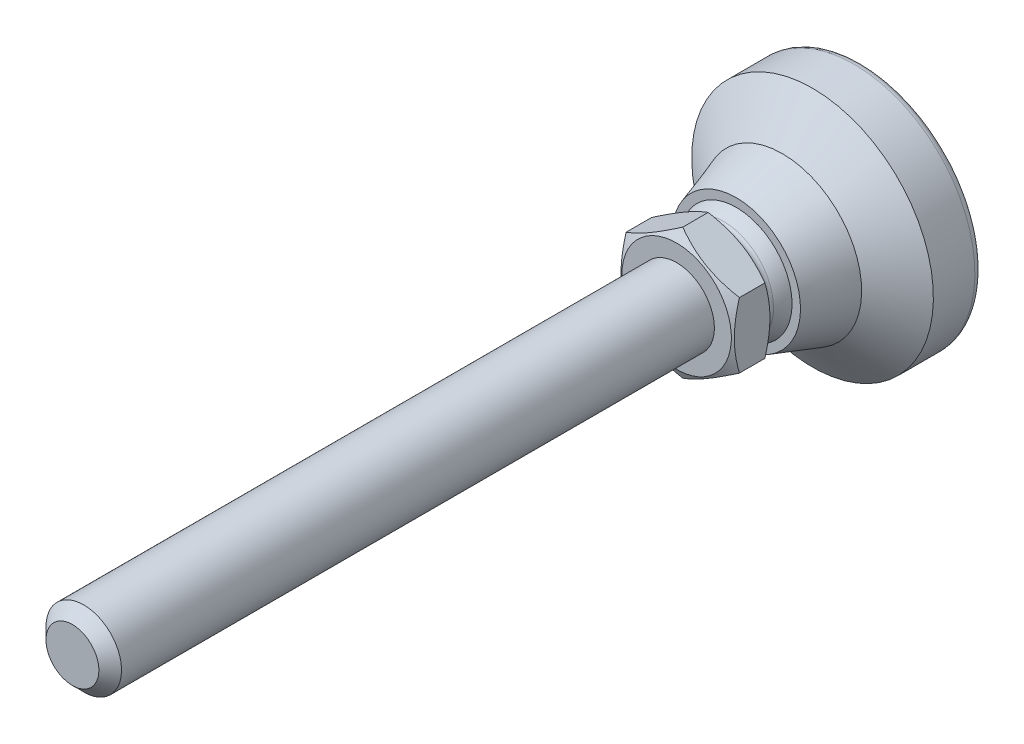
ISO-10303-21;
HEADER;
FILE_DESCRIPTION(('STEP AP214'),'2;1');
FILE_NAME('part.step','',(''),(''),'','','');
FILE_SCHEMA(('AUTOMOTIVE_DESIGN { 1 0 10303 214 1 1 1 1 }'));
ENDSEC;
DATA;
#1=APPLICATION_CONTEXT('core data for automotive mechanical design processes');
#2=APPLICATION_PROTOCOL_DEFINITION('international standard','automotive_design',2000,#1);
#3=PRODUCT_CONTEXT('',#1,'mechanical');
#4=PRODUCT('Part','Part','',(#3));
#5=PRODUCT_RELATED_PRODUCT_CATEGORY('part','',(#4));
#6=PRODUCT_DEFINITION_FORMATION('','',#4);
#7=PRODUCT_DEFINITION_CONTEXT('part definition',#1,'design');
#8=PRODUCT_DEFINITION('design','',#6,#7);
#9=PRODUCT_DEFINITION_SHAPE('','',#8);
#10=(LENGTH_UNIT() NAMED_UNIT(*) SI_UNIT(.MILLI.,.METRE.));
#11=(NAMED_UNIT(*) PLANE_ANGLE_UNIT() SI_UNIT($,.RADIAN.));
#12=(NAMED_UNIT(*) SI_UNIT($,.STERADIAN.) SOLID_ANGLE_UNIT());
#13=UNCERTAINTY_MEASURE_WITH_UNIT(LENGTH_MEASURE(1.E-05),#10,'distance_accuracy_value','');
#14=(GEOMETRIC_REPRESENTATION_CONTEXT(3) GLOBAL_UNCERTAINTY_ASSIGNED_CONTEXT((#13)) GLOBAL_UNIT_ASSIGNED_CONTEXT((#10,
#11,#12)) REPRESENTATION_CONTEXT('',''));
#15=CARTESIAN_POINT('',(0.,0.,0.));
#16=DIRECTION('',(0.,0.,1.));
#17=DIRECTION('',(1.,0.,0.));
#18=AXIS2_PLACEMENT_3D('',#15,#16,#17);
#19=CARTESIAN_POINT('',(0.,0.,18.7011230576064));
#20=DIRECTION('',(0.,0.,-1.));
#21=DIRECTION('',(0.,1.,0.));
#22=AXIS2_PLACEMENT_3D('',#19,#20,#21);
#23=TOROIDAL_SURFACE('',#22,7.30000010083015,0.799999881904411);
#24=CARTESIAN_POINT('',(0.,0.,19.5000000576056));
#25=DIRECTION('',(0.,0.,1.));
#26=DIRECTION('',(1.,0.,0.));
#27=AXIS2_PLACEMENT_3D('',#24,#25,#26);
#28=CIRCLE('',#27,7.25762853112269);
#29=CARTESIAN_POINT('',(7.25762853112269,0.,19.5000000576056));
#30=VERTEX_POINT('',#29);
#31=EDGE_CURVE('E264',#30,#30,#28,.F.);
#32=ORIENTED_EDGE('',*,*,#31,.T.);
#33=EDGE_LOOP('',(#32));
#34=FACE_BOUND('',#33,.T.);
#35=CARTESIAN_POINT('',(0.,0.,18.2846441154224));
#36=DIRECTION('',(0.,0.,-1.));
#37=DIRECTION('',(0.,1.,0.));
#38=AXIS2_PLACEMENT_3D('',#35,#36,#37);
#39=CIRCLE('',#38,6.61695903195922);
#40=CARTESIAN_POINT('',(-6.61695903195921,0.,18.2846441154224));
#41=VERTEX_POINT('',#40);
#42=EDGE_CURVE('E73',#41,#41,#39,.T.);
#43=ORIENTED_EDGE('',*,*,#42,.F.);
#44=EDGE_LOOP('',(#43));
#45=FACE_BOUND('',#44,.T.);
#46=ADVANCED_FACE('F14',(#34,#45),#23,.F.);
#47=CARTESIAN_POINT('',(0.,0.,14.249999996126));
#48=DIRECTION('',(0.,0.,-1.));
#49=DIRECTION('',(-1.,0.,0.));
#50=AXIS2_PLACEMENT_3D('',#47,#48,#49);
#51=SPHERICAL_SURFACE('',#50,7.75);
#52=CARTESIAN_POINT('',(0.,0.,16.6));
#53=DIRECTION('',(0.,0.,-1.));
#54=DIRECTION('',(0.,1.,0.));
#55=AXIS2_PLACEMENT_3D('',#52,#53,#54);
#56=CIRCLE('',#55,7.38512017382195);
#57=CARTESIAN_POINT('',(-7.38512017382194,0.,16.6));
#58=VERTEX_POINT('',#57);
#59=EDGE_CURVE('E120',#58,#58,#56,.T.);
#60=CARTESIAN_POINT('',(-7.38512017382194,0.,16.6));
#61=CARTESIAN_POINT('',(-7.37925798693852,0.,16.6184225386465));
#62=CARTESIAN_POINT('',(-7.37332686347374,0.,16.6368231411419));
#63=CARTESIAN_POINT('',(-7.36132708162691,0.,16.6735794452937));
#64=CARTESIAN_POINT('',(-7.35525842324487,0.,16.6919351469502));
#65=CARTESIAN_POINT('',(-7.34298390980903,0.,16.7286006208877));
#66=CARTESIAN_POINT('',(-7.33677805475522,0.,16.7469103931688));
#67=CARTESIAN_POINT('',(-7.3242294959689,0.,16.7834829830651));
#68=CARTESIAN_POINT('',(-7.31788679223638,0.,16.8017458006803));
#69=CARTESIAN_POINT('',(-7.30506489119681,0.,16.8382234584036));
#70=CARTESIAN_POINT('',(-7.29858569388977,0.,16.8564382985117));
#71=CARTESIAN_POINT('',(-7.28549116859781,0.,16.8928189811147));
#72=CARTESIAN_POINT('',(-7.2788758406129,0.,16.9109848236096));
#73=CARTESIAN_POINT('',(-7.2655094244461,0.,16.9472664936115));
#74=CARTESIAN_POINT('',(-7.25875833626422,0.,16.9653823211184));
#75=CARTESIAN_POINT('',(-7.24512077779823,0.,17.0015629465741));
#76=CARTESIAN_POINT('',(-7.23823430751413,0.,17.0196277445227));
#77=CARTESIAN_POINT('',(-7.22432637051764,0.,17.0557052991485));
#78=CARTESIAN_POINT('',(-7.21730490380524,0.,17.0737180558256));
#79=CARTESIAN_POINT('',(-7.20312736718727,0.,17.1096905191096));
#80=CARTESIAN_POINT('',(-7.19597129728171,0.,17.1276502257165));
#81=CARTESIAN_POINT('',(-7.18152495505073,0.,17.1635155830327));
#82=CARTESIAN_POINT('',(-7.17423468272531,0.,17.1814212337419));
#83=CARTESIAN_POINT('',(-7.15952034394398,0.,17.2171774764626));
#84=CARTESIAN_POINT('',(-7.15209627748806,0.,17.235028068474));
#85=CARTESIAN_POINT('',(-7.13711476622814,0.,17.2706731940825));
#86=CARTESIAN_POINT('',(-7.12955732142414,0.,17.2884677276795));
#87=CARTESIAN_POINT('',(-7.11430947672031,0.,17.323999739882));
#88=CARTESIAN_POINT('',(-7.10661907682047,0.,17.3417372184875));
#89=CARTESIAN_POINT('',(-7.0911057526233,0.,17.3771541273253));
#90=CARTESIAN_POINT('',(-7.08328282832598,0.,17.3948335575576));
#91=CARTESIAN_POINT('',(-7.06750489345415,0.,17.4301333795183));
#92=CARTESIAN_POINT('',(-7.05954988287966,0.,17.4477537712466));
#93=CARTESIAN_POINT('',(-7.0435082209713,0.,17.482934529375));
#94=CARTESIAN_POINT('',(-7.03542156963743,0.,17.5004948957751));
#95=CARTESIAN_POINT('',(-7.01911707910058,0.,17.5355546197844));
#96=CARTESIAN_POINT('',(-7.01089923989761,0.,17.5530539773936));
#97=CARTESIAN_POINT('',(-6.99433283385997,0.,17.5879907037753));
#98=CARTESIAN_POINT('',(-6.98598426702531,0.,17.6054280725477));
#99=CARTESIAN_POINT('',(-6.96915687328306,0.,17.6402398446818));
#100=CARTESIAN_POINT('',(-6.96067804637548,0.,17.6576142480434));
#101=CARTESIAN_POINT('',(-6.94359060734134,0.,17.692299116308));
#102=CARTESIAN_POINT('',(-6.93498199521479,0.,17.7096095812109));
#103=CARTESIAN_POINT('',(-6.91763546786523,0.,17.7441656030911));
#104=CARTESIAN_POINT('',(-6.90889755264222,0.,17.7614111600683));
#105=CARTESIAN_POINT('',(-6.89129290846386,0.,17.7958364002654));
#106=CARTESIAN_POINT('',(-6.8824261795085,0.,17.8130160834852));
#107=CARTESIAN_POINT('',(-6.86456440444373,0.,17.8473086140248));
#108=CARTESIAN_POINT('',(-6.85556935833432,0.,17.8644214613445));
#109=CARTESIAN_POINT('',(-6.83745145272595,0.,17.8985793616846));
#110=CARTESIAN_POINT('',(-6.82832859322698,0.,17.9156244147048));
#111=CARTESIAN_POINT('',(-6.80995557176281,0.,17.9496457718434));
#112=CARTESIAN_POINT('',(-6.80070540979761,0.,17.9666220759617));
#113=CARTESIAN_POINT('',(-6.78207830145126,0.,18.0005049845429));
#114=CARTESIAN_POINT('',(-6.7727013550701,0.,18.0174115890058));
#115=CARTESIAN_POINT('',(-6.75382120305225,0.,18.0511541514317));
#116=CARTESIAN_POINT('',(-6.74431799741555,0.,18.0679901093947));
#117=CARTESIAN_POINT('',(-6.72518585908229,0.,18.1015904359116));
#118=CARTESIAN_POINT('',(-6.71555692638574,0.,18.1183548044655));
#119=CARTESIAN_POINT('',(-6.69617387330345,0.,18.1518110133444));
#120=CARTESIAN_POINT('',(-6.68641975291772,0.,18.1685028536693));
#121=CARTESIAN_POINT('',(-6.66678687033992,0.,18.2018130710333));
#122=CARTESIAN_POINT('',(-6.65690810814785,0.,18.2184314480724));
#123=CARTESIAN_POINT('',(-6.63702649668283,0.,18.2515938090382));
#124=CARTESIAN_POINT('',(-6.62702364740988,0.,18.2681377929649));
#125=CARTESIAN_POINT('',(-6.61695903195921,0.,18.2846441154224));
#126=B_SPLINE_CURVE_WITH_KNOTS('',3,(#60,#61,#62,#63,#64,#65,#66,#67,#68,#69,#70,#71,#72,#73,
#74,#75,#76,#77,#78,#79,#80,#81,#82,#83,#84,#85,#86,#87,#88,#89,#90,#91,#92,#93,#94,#95,#96,#97,
#98,#99,#100,#101,#102,#103,#104,#105,#106,#107,#108,#109,#110,#111,#112,#113,#114,#115,#116,
#117,#118,#119,#120,#121,#122,#123,#124,#125),.UNSPECIFIED.,.F.,.F.,(4,2,2,2,2,2,2,2,2,2,2,2,2,
2,2,2,2,2,2,2,2,2,2,2,2,2,2,2,2,2,2,2,4),(0.,0.0579981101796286,0.115996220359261,
0.173994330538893,0.231992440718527,0.289990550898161,0.347988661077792,0.405986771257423,
0.463984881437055,0.521982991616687,0.579981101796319,0.637979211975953,0.695977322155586,
0.753975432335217,0.811973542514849,0.86997165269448,0.927969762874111,0.985967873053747,
1.04396598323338,1.10196409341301,1.15996220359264,1.21796031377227,1.27595842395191,
1.33395653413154,1.39195464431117,1.4499527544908,1.50795086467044,1.56594897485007,
1.6239470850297,1.68194519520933,1.73994330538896,1.7979414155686,1.85593952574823),.UNSPECIFIED.);
#127=EDGE_CURVE('BSEAM241',#58,#41,#126,.T.);
#128=ORIENTED_EDGE('',*,*,#59,.F.);
#129=ORIENTED_EDGE('',*,*,#42,.T.);
#130=ORIENTED_EDGE('',*,*,#127,.T.);
#131=ORIENTED_EDGE('',*,*,#127,.F.);
#132=EDGE_LOOP('',(#128,#130,#129,#131));
#133=FACE_BOUND('',#132,.T.);
#134=ADVANCED_FACE('F241',(#133),#51,.T.);
#135=CARTESIAN_POINT('',(-7.38512017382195,0.,16.6));
#136=DIRECTION('',(0.,0.,-1.));
#137=DIRECTION('',(0.,1.,0.));
#138=AXIS2_PLACEMENT_3D('',#135,#136,#137);
#139=PLANE('',#138);
#140=CARTESIAN_POINT('',(0.,0.,16.6));
#141=DIRECTION('',(0.,0.,-1.));
#142=DIRECTION('',(0.,1.,0.));
#143=AXIS2_PLACEMENT_3D('',#140,#141,#142);
#144=CIRCLE('',#143,8.5);
#145=CARTESIAN_POINT('',(0.,8.5,16.6));
#146=VERTEX_POINT('',#145);
#147=EDGE_CURVE('E117',#146,#146,#144,.T.);
#148=ORIENTED_EDGE('',*,*,#147,.F.);
#149=EDGE_LOOP('',(#148));
#150=FACE_BOUND('',#149,.T.);
#151=ORIENTED_EDGE('',*,*,#59,.T.);
#152=EDGE_LOOP('',(#151));
#153=FACE_BOUND('',#152,.T.);
#154=ADVANCED_FACE('F247',(#150,#153),#139,.F.);
#155=CARTESIAN_POINT('',(0.,0.,16.6));
#156=DIRECTION('',(0.,0.,-1.));
#157=DIRECTION('',(0.,1.,0.));
#158=AXIS2_PLACEMENT_3D('',#155,#156,#157);
#159=CONICAL_SURFACE('',#158,8.5,0.316824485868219);
#160=CARTESIAN_POINT('',(0.,0.,10.5));
#161=DIRECTION('',(0.,0.,-1.));
#162=DIRECTION('',(0.,1.,0.));
#163=AXIS2_PLACEMENT_3D('',#160,#161,#162);
#164=CIRCLE('',#163,10.5);
#165=CARTESIAN_POINT('',(0.,10.5,10.5));
#166=VERTEX_POINT('',#165);
#167=EDGE_CURVE('E114',#166,#166,#164,.T.);
#168=ORIENTED_EDGE('',*,*,#167,.F.);
#169=EDGE_LOOP('',(#168));
#170=FACE_BOUND('',#169,.T.);
#171=ORIENTED_EDGE('',*,*,#147,.T.);
#172=EDGE_LOOP('',(#171));
#173=FACE_BOUND('',#172,.T.);
#174=ADVANCED_FACE('F290',(#170,#173),#159,.T.);
#175=CARTESIAN_POINT('',(0.,0.,10.5));
#176=DIRECTION('',(0.,0.,-1.));
#177=DIRECTION('',(0.,1.,0.));
#178=AXIS2_PLACEMENT_3D('',#175,#176,#177);
#179=CONICAL_SURFACE('',#178,10.5,0.942000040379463);
#180=CARTESIAN_POINT('',(0.,0.,6.5));
#181=DIRECTION('',(0.,0.,-1.));
#182=DIRECTION('',(0.,1.,0.));
#183=AXIS2_PLACEMENT_3D('',#180,#181,#182);
#184=CIRCLE('',#183,16.);
#185=CARTESIAN_POINT('',(0.,16.,6.5));
#186=VERTEX_POINT('',#185);
#187=EDGE_CURVE('E111',#186,#186,#184,.T.);
#188=ORIENTED_EDGE('',*,*,#187,.F.);
#189=EDGE_LOOP('',(#188));
#190=FACE_BOUND('',#189,.T.);
#191=ORIENTED_EDGE('',*,*,#167,.T.);
#192=EDGE_LOOP('',(#191));
#193=FACE_BOUND('',#192,.T.);
#194=ADVANCED_FACE('F286',(#190,#193),#179,.T.);
#195=CARTESIAN_POINT('',(0.,0.,0.));
#196=DIRECTION('',(0.,0.,-1.));
#197=DIRECTION('',(0.,1.,0.));
#198=AXIS2_PLACEMENT_3D('',#195,#196,#197);
#199=CYLINDRICAL_SURFACE('',#198,16.);
#200=CARTESIAN_POINT('',(0.,0.,1.));
#201=DIRECTION('',(0.,0.,-1.));
#202=DIRECTION('',(0.,1.,0.));
#203=AXIS2_PLACEMENT_3D('',#200,#201,#202);
#204=CIRCLE('',#203,16.);
#205=CARTESIAN_POINT('',(0.,16.,1.));
#206=VERTEX_POINT('',#205);
#207=EDGE_CURVE('E88',#206,#206,#204,.T.);
#208=ORIENTED_EDGE('',*,*,#207,.F.);
#209=EDGE_LOOP('',(#208));
#210=FACE_BOUND('',#209,.T.);
#211=ORIENTED_EDGE('',*,*,#187,.T.);
#212=EDGE_LOOP('',(#211));
#213=FACE_BOUND('',#212,.T.);
#214=ADVANCED_FACE('F280',(#210,#213),#199,.T.);
#215=CARTESIAN_POINT('',(0.,0.,1.));
#216=DIRECTION('',(0.,0.,-1.));
#217=DIRECTION('',(0.,1.,0.));
#218=AXIS2_PLACEMENT_3D('',#215,#216,#217);
#219=TOROIDAL_SURFACE('',#218,15.,1.);
#220=CARTESIAN_POINT('',(0.,0.,0.));
#221=DIRECTION('',(0.,0.,-1.));
#222=DIRECTION('',(0.,1.,0.));
#223=AXIS2_PLACEMENT_3D('',#220,#221,#222);
#224=CIRCLE('',#223,15.);
#225=CARTESIAN_POINT('',(0.,15.,0.));
#226=VERTEX_POINT('',#225);
#227=EDGE_CURVE('E85',#226,#226,#224,.T.);
#228=ORIENTED_EDGE('',*,*,#227,.F.);
#229=EDGE_LOOP('',(#228));
#230=FACE_BOUND('',#229,.T.);
#231=ORIENTED_EDGE('',*,*,#207,.T.);
#232=EDGE_LOOP('',(#231));
#233=FACE_BOUND('',#232,.T.);
#234=ADVANCED_FACE('F273',(#230,#233),#219,.T.);
#235=CARTESIAN_POINT('',(-15.,0.,0.));
#236=DIRECTION('',(0.,0.,1.));
#237=DIRECTION('',(0.,-1.,0.));
#238=AXIS2_PLACEMENT_3D('',#235,#236,#237);
#239=PLANE('',#238);
#240=ORIENTED_EDGE('',*,*,#227,.T.);
#241=EDGE_LOOP('',(#240));
#242=FACE_BOUND('',#241,.T.);
#243=ADVANCED_FACE('F268',(#242),#239,.F.);
#244=CARTESIAN_POINT('',(0.,7.25,19.5000000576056));
#245=DIRECTION('',(0.,0.,-1.));
#246=DIRECTION('',(-1.,0.,0.));
#247=AXIS2_PLACEMENT_3D('',#244,#245,#246);
#248=PLANE('',#247);
#249=CARTESIAN_POINT('',(0.,0.,19.5000000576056));
#250=DIRECTION('',(0.,0.,-1.));
#251=DIRECTION('',(-1.,0.,0.));
#252=AXIS2_PLACEMENT_3D('',#249,#250,#251);
#253=CIRCLE('',#252,7.25);
#254=CARTESIAN_POINT('',(-7.25,0.,19.5000000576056));
#255=VERTEX_POINT('',#254);
#256=EDGE_CURVE('E79',#255,#255,#253,.T.);
#257=ORIENTED_EDGE('',*,*,#256,.T.);
#258=EDGE_LOOP('',(#257));
#259=FACE_BOUND('',#258,.T.);
#260=ORIENTED_EDGE('',*,*,#31,.F.);
#261=EDGE_LOOP('',(#260));
#262=FACE_BOUND('',#261,.T.);
#263=ADVANCED_FACE('F139',(#259,#262),#248,.F.);
#264=CARTESIAN_POINT('',(0.,0.,21.1177006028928));
#265=DIRECTION('',(0.,0.,1.));
#266=DIRECTION('',(1.,0.,0.));
#267=AXIS2_PLACEMENT_3D('',#264,#265,#266);
#268=CONICAL_SURFACE('',#267,10.0519395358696,1.0471975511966);
#269=CARTESIAN_POINT('',(-7.5002,4.33001154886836,20.3142772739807));
#270=CARTESIAN_POINT('',(-7.3353416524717,4.42519256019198,20.2593328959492));
#271=CARTESIAN_POINT('',(-7.16986863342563,4.52072845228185,20.2068821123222));
#272=CARTESIAN_POINT('',(-6.83757877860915,4.71257608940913,20.1076545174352));
#273=CARTESIAN_POINT('',(-6.67076139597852,4.80888815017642,20.0608801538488));
#274=CARTESIAN_POINT('',(-6.16763831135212,5.09936639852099,19.9299898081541));
#275=CARTESIAN_POINT('',(-5.82934661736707,5.29467919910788,19.8555409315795));
#276=CARTESIAN_POINT('',(-5.32309925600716,5.58696124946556,19.7682409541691));
#277=CARTESIAN_POINT('',(-5.15665618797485,5.68305719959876,19.7433717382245));
#278=CARTESIAN_POINT('',(-4.82301799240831,5.87568330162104,19.7016697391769));
#279=CARTESIAN_POINT('',(-4.65582293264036,5.97221341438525,19.6848362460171));
#280=CARTESIAN_POINT('',(-4.32114243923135,6.16544128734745,19.6596346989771));
#281=CARTESIAN_POINT('',(-4.15365755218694,6.26213873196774,19.6512570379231));
#282=CARTESIAN_POINT('',(-3.81854232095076,6.45561760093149,19.6431378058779));
#283=CARTESIAN_POINT('',(-3.65091198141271,6.55239902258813,19.6433959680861));
#284=CARTESIAN_POINT('',(-3.19166219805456,6.81754700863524,19.6559736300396));
#285=CARTESIAN_POINT('',(-2.90019309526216,6.98582677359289,19.6770872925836));
#286=CARTESIAN_POINT('',(-2.31919079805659,7.32126860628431,19.7440382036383));
#287=CARTESIAN_POINT('',(-2.02965964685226,7.48842949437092,19.7898983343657));
#288=CARTESIAN_POINT('',(-1.44748813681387,7.82454637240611,19.9045350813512));
#289=CARTESIAN_POINT('',(-1.15492123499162,7.99345995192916,19.9737973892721));
#290=CARTESIAN_POINT('',(-0.574150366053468,8.3287681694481,20.1309947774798));
#291=CARTESIAN_POINT('',(-0.285938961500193,8.49516710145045,20.2188929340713));
#292=CARTESIAN_POINT('',(0.000200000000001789,8.66036950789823,20.3142772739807));
#293=B_SPLINE_CURVE_WITH_KNOTS('',3,(#269,#270,#271,#272,#273,#274,#275,#276,#277,#278,#279,
#280,#281,#282,#283,#284,#285,#286,#287,#288,#289,#290,#291,#292),.UNSPECIFIED.,.F.,.F.,(4,2,2,
2,2,2,2,2,2,2,2,4),(0.,0.594350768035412,1.1889569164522,2.38063993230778,2.96188692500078,
3.54308254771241,4.12361709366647,4.70413370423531,5.7147367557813,6.72627588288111,
7.7602492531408,8.79219281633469),.UNSPECIFIED.);
#294=CARTESIAN_POINT('',(-7.5,4.3301270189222,20.3142106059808));
#295=VERTEX_POINT('',#294);
#296=CARTESIAN_POINT('',(0.,8.66025403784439,20.3142106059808));
#297=VERTEX_POINT('',#296);
#298=EDGE_CURVE('E29',#295,#297,#293,.T.);
#299=ORIENTED_EDGE('',*,*,#298,.T.);
#300=CARTESIAN_POINT('',(-0.000199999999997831,8.66036950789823,20.3142772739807));
#301=CARTESIAN_POINT('',(0.164658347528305,8.56518849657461,20.2593328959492));
#302=CARTESIAN_POINT('',(0.330131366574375,8.46965260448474,20.2068821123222));
#303=CARTESIAN_POINT('',(0.662421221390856,8.27780496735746,20.1076545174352));
#304=CARTESIAN_POINT('',(0.829238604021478,8.18149290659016,20.0608801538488));
#305=CARTESIAN_POINT('',(1.33236168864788,7.8910146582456,19.9299898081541));
#306=CARTESIAN_POINT('',(1.67065338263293,7.69570185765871,19.8555409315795));
#307=CARTESIAN_POINT('',(2.17690074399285,7.40341980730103,19.7682409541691));
#308=CARTESIAN_POINT('',(2.34334381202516,7.30732385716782,19.7433717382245));
#309=CARTESIAN_POINT('',(2.67698200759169,7.11469775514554,19.7016697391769));
#310=CARTESIAN_POINT('',(2.84417706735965,7.01816764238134,19.6848362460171));
#311=CARTESIAN_POINT('',(3.17885756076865,6.82493976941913,19.6596346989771));
#312=CARTESIAN_POINT('',(3.34634244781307,6.72824232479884,19.6512570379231));
#313=CARTESIAN_POINT('',(3.68145767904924,6.5347634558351,19.6431378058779));
#314=CARTESIAN_POINT('',(3.8490880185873,6.43798203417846,19.6433959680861));
#315=CARTESIAN_POINT('',(4.30833780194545,6.17283404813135,19.6559736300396));
#316=CARTESIAN_POINT('',(4.59980690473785,6.0045542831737,19.6770872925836));
#317=CARTESIAN_POINT('',(5.18080920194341,5.66911245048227,19.7440382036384));
#318=CARTESIAN_POINT('',(5.47034035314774,5.50195156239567,19.7898983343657));
#319=CARTESIAN_POINT('',(6.05251186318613,5.16583468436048,19.9045350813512));
#320=CARTESIAN_POINT('',(6.34507876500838,4.99692110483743,19.9737973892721));
#321=CARTESIAN_POINT('',(6.92584963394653,4.66161288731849,20.1309947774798));
#322=CARTESIAN_POINT('',(7.21406103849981,4.49521395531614,20.2188929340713));
#323=CARTESIAN_POINT('',(7.5002,4.33001154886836,20.3142772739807));
#324=B_SPLINE_CURVE_WITH_KNOTS('',3,(#300,#301,#302,#303,#304,#305,#306,#307,#308,#309,#310,
#311,#312,#313,#314,#315,#316,#317,#318,#319,#320,#321,#322,#323),.UNSPECIFIED.,.F.,.F.,(4,2,2,
2,2,2,2,2,2,2,2,4),(0.,0.594350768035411,1.1889569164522,2.38063993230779,2.96188692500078,
3.54308254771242,4.12361709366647,4.70413370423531,5.71473675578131,6.7262758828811,
7.76024925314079,8.79219281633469),.UNSPECIFIED.);
#325=CARTESIAN_POINT('',(7.5,4.3301270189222,20.3142106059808));
#326=VERTEX_POINT('',#325);
#327=EDGE_CURVE('E66',#297,#326,#324,.T.);
#328=ORIENTED_EDGE('',*,*,#327,.T.);
#329=CARTESIAN_POINT('',(7.5,-11.5758131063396,23.2776572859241));
#330=CARTESIAN_POINT('',(7.5,-11.2486985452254,23.1192011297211));
#331=CARTESIAN_POINT('',(7.5,-10.92082708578,22.9622804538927));
#332=CARTESIAN_POINT('',(7.5,-10.2631676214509,22.6523747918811));
#333=CARTESIAN_POINT('',(7.5,-9.93337931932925,22.4993904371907));
#334=CARTESIAN_POINT('',(7.5,-9.26975750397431,22.1974405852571));
#335=CARTESIAN_POINT('',(7.5,-8.93591170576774,22.0485019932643));
#336=CARTESIAN_POINT('',(7.5,-8.26554536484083,21.7567944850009));
#337=CARTESIAN_POINT('',(7.5,-7.92902495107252,21.6140252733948));
#338=CARTESIAN_POINT('',(7.5,-7.24212993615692,21.3319157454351));
#339=CARTESIAN_POINT('',(7.5,-6.89165247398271,21.1928244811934));
#340=CARTESIAN_POINT('',(7.5,-6.18657762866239,20.9253037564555));
#341=CARTESIAN_POINT('',(7.5,-5.83197978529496,20.7968755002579));
#342=CARTESIAN_POINT('',(7.5,-5.11877756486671,20.5540933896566));
#343=CARTESIAN_POINT('',(7.5,-4.76018316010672,20.4397105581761));
#344=CARTESIAN_POINT('',(7.5,-4.03786411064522,20.228724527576));
#345=CARTESIAN_POINT('',(7.5,-3.67414113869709,20.1321156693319));
#346=CARTESIAN_POINT('',(7.5,-2.94330443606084,19.9618673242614));
#347=CARTESIAN_POINT('',(7.5,-2.57622001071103,19.8881054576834));
#348=CARTESIAN_POINT('',(7.5,-2.02229540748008,19.7978191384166));
#349=CARTESIAN_POINT('',(7.5,-1.83709018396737,19.7711152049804));
#350=CARTESIAN_POINT('',(7.5,-1.46577815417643,19.725017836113));
#351=CARTESIAN_POINT('',(7.5,-1.27967143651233,19.7056236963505));
#352=CARTESIAN_POINT('',(7.5,-0.909212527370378,19.6747726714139));
#353=CARTESIAN_POINT('',(7.5,-0.724868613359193,19.6632167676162));
#354=CARTESIAN_POINT('',(7.5,-0.355857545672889,19.647906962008));
#355=CARTESIAN_POINT('',(7.5,-0.171190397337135,19.6441529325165));
#356=CARTESIAN_POINT('',(7.5,0.198137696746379,19.6445362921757));
#357=CARTESIAN_POINT('',(7.5,0.382798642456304,19.6486737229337));
#358=CARTESIAN_POINT('',(7.5,0.751783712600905,19.6647398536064));
#359=CARTESIAN_POINT('',(7.5,0.93610781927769,19.6766689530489));
#360=CARTESIAN_POINT('',(7.5,1.38078988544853,19.7145962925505));
#361=CARTESIAN_POINT('',(7.5,1.64083115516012,19.7443854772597));
#362=CARTESIAN_POINT('',(7.5,2.15893480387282,19.8178333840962));
#363=CARTESIAN_POINT('',(7.5,2.41699690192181,19.8614940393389));
#364=CARTESIAN_POINT('',(7.5,3.18794688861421,20.0109638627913));
#365=CARTESIAN_POINT('',(7.5,3.69730058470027,20.1352321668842));
#366=CARTESIAN_POINT('',(7.5,4.45884729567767,20.350108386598));
#367=CARTESIAN_POINT('',(7.5,4.71500581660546,20.4274651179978));
#368=CARTESIAN_POINT('',(7.5,5.22483384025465,20.5900595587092));
#369=CARTESIAN_POINT('',(7.5,5.47850332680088,20.6752973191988));
#370=CARTESIAN_POINT('',(7.5,5.9834360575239,20.8522990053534));
#371=CARTESIAN_POINT('',(7.5,6.23470009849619,20.9440606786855));
#372=CARTESIAN_POINT('',(7.5,6.73515677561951,21.1330458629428));
#373=CARTESIAN_POINT('',(7.5,6.98434943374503,21.2302693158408));
#374=CARTESIAN_POINT('',(7.5,7.5629390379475,21.4621490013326));
#375=CARTESIAN_POINT('',(7.5,7.89163158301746,21.5985593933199));
#376=CARTESIAN_POINT('',(7.5,8.54630249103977,21.8777627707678));
#377=CARTESIAN_POINT('',(7.5,8.87228070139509,22.0205561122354));
#378=CARTESIAN_POINT('',(7.5,9.52200980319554,22.3112700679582));
#379=CARTESIAN_POINT('',(7.5,9.84576026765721,22.4591916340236));
#380=CARTESIAN_POINT('',(7.5,10.4913488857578,22.7591577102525));
#381=CARTESIAN_POINT('',(7.5,10.8131870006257,22.9112023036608));
#382=CARTESIAN_POINT('',(7.5,11.4555752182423,23.2188077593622));
#383=CARTESIAN_POINT('',(7.5,11.7761236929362,23.3743720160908));
#384=CARTESIAN_POINT('',(7.5,12.4158574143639,23.6882812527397));
#385=CARTESIAN_POINT('',(7.5,12.7350426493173,23.8466262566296));
#386=CARTESIAN_POINT('',(7.5,13.6907942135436,24.3250671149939));
#387=CARTESIAN_POINT('',(7.5,14.3256361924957,24.6486073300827));
#388=CARTESIAN_POINT('',(7.5,15.5404354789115,25.2755960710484));
#389=CARTESIAN_POINT('',(7.5,16.1206556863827,25.5785374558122));
#390=CARTESIAN_POINT('',(7.5,17.2789319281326,26.188572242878));
#391=CARTESIAN_POINT('',(7.5,17.8569878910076,26.4956657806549));
#392=CARTESIAN_POINT('',(7.5,19.0100376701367,27.1122939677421));
#393=CARTESIAN_POINT('',(7.5,19.5850354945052,27.4218211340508));
#394=CARTESIAN_POINT('',(7.5,20.7336417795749,28.0433721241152));
#395=CARTESIAN_POINT('',(7.5,21.307250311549,28.3553958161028));
#396=CARTESIAN_POINT('',(7.5,21.8803447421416,28.6683546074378));
#397=B_SPLINE_CURVE_WITH_KNOTS('',3,(#329,#330,#331,#332,#333,#334,#335,#336,#337,#338,#339,
#340,#341,#342,#343,#344,#345,#346,#347,#348,#349,#350,#351,#352,#353,#354,#355,#356,#357,#358,
#359,#360,#361,#362,#363,#364,#365,#366,#367,#368,#369,#370,#371,#372,#373,#374,#375,#376,#377,
#378,#379,#380,#381,#382,#383,#384,#385,#386,#387,#388,#389,#390,#391,#392,#393,#394,#395,#396),
.UNSPECIFIED.,.F.,.F.,(4,2,2,2,2,2,2,2,2,2,2,2,2,2,2,2,2,2,2,2,2,2,2,2,2,2,2,2,2,2,2,2,2,4),(0.,
1.09043121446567,2.18103628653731,3.27767289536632,4.37425694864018,5.50532856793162,
6.63652775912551,7.76535250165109,8.89381720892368,10.0161283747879,10.5773682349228,
11.1385540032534,11.6925113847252,12.2464597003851,12.8004109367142,13.3543905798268,
14.1391718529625,14.9240625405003,16.4947377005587,17.2974250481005,18.100117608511,
18.9025343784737,19.7049426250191,20.772475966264,21.8400689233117,22.9078611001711,
23.9756748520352,25.0445664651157,26.1134672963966,28.2510031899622,30.2146197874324,
32.1783006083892,34.1373412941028,36.0962792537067),.UNSPECIFIED.);
#398=CARTESIAN_POINT('',(7.5,-4.3301270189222,20.3142106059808));
#399=VERTEX_POINT('',#398);
#400=EDGE_CURVE('E69',#326,#399,#397,.F.);
#401=ORIENTED_EDGE('',*,*,#400,.T.);
#402=CARTESIAN_POINT('',(7.5002,-4.33001154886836,20.3142772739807));
#403=CARTESIAN_POINT('',(7.3353416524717,-4.42519256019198,20.2593328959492));
#404=CARTESIAN_POINT('',(7.16986863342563,-4.52072845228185,20.2068821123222));
#405=CARTESIAN_POINT('',(6.83757877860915,-4.71257608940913,20.1076545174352));
#406=CARTESIAN_POINT('',(6.67076139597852,-4.80888815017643,20.0608801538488));
#407=CARTESIAN_POINT('',(6.16763831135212,-5.09936639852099,19.9299898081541));
#408=CARTESIAN_POINT('',(5.82934661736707,-5.29467919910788,19.8555409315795));
#409=CARTESIAN_POINT('',(5.32309925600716,-5.58696124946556,19.7682409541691));
#410=CARTESIAN_POINT('',(5.15665618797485,-5.68305719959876,19.7433717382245));
#411=CARTESIAN_POINT('',(4.82301799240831,-5.87568330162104,19.7016697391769));
#412=CARTESIAN_POINT('',(4.65582293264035,-5.97221341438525,19.6848362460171));
#413=CARTESIAN_POINT('',(4.32114243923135,-6.16544128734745,19.6596346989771));
#414=CARTESIAN_POINT('',(4.15365755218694,-6.26213873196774,19.6512570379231));
#415=CARTESIAN_POINT('',(3.81854232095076,-6.45561760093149,19.6431378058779));
#416=CARTESIAN_POINT('',(3.65091198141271,-6.55239902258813,19.6433959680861));
#417=CARTESIAN_POINT('',(3.19166219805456,-6.81754700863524,19.6559736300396));
#418=CARTESIAN_POINT('',(2.90019309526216,-6.98582677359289,19.6770872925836));
#419=CARTESIAN_POINT('',(2.31919079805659,-7.32126860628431,19.7440382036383));
#420=CARTESIAN_POINT('',(2.02965964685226,-7.48842949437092,19.7898983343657));
#421=CARTESIAN_POINT('',(1.44748813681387,-7.82454637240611,19.9045350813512));
#422=CARTESIAN_POINT('',(1.15492123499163,-7.99345995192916,19.9737973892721));
#423=CARTESIAN_POINT('',(0.574150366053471,-8.3287681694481,20.1309947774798));
#424=CARTESIAN_POINT('',(0.285938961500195,-8.49516710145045,20.2188929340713));
#425=CARTESIAN_POINT('',(-0.000199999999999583,-8.66036950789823,20.3142772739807));
#426=B_SPLINE_CURVE_WITH_KNOTS('',3,(#402,#403,#404,#405,#406,#407,#408,#409,#410,#411,#412,
#413,#414,#415,#416,#417,#418,#419,#420,#421,#422,#423,#424,#425),.UNSPECIFIED.,.F.,.F.,(4,2,2,
2,2,2,2,2,2,2,2,4),(0.,0.594350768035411,1.1889569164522,2.38063993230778,2.96188692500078,
3.54308254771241,4.12361709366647,4.7041337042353,5.7147367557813,6.7262758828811,
7.76024925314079,8.79219281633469),.UNSPECIFIED.);
#427=CARTESIAN_POINT('',(0.,-8.66025403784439,20.3142106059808));
#428=VERTEX_POINT('',#427);
#429=EDGE_CURVE('E78',#399,#428,#426,.T.);
#430=ORIENTED_EDGE('',*,*,#429,.T.);
#431=CARTESIAN_POINT('',(0.000200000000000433,-8.66036950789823,20.3142772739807));
#432=CARTESIAN_POINT('',(-0.164658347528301,-8.56518849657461,20.2593328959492));
#433=CARTESIAN_POINT('',(-0.330131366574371,-8.46965260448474,20.2068821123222));
#434=CARTESIAN_POINT('',(-0.662421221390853,-8.27780496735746,20.1076545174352));
#435=CARTESIAN_POINT('',(-0.829238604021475,-8.18149290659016,20.0608801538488));
#436=CARTESIAN_POINT('',(-1.33236168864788,-7.89101465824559,19.9299898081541));
#437=CARTESIAN_POINT('',(-1.67065338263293,-7.69570185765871,19.8555409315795));
#438=CARTESIAN_POINT('',(-2.17690074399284,-7.40341980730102,19.7682409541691));
#439=CARTESIAN_POINT('',(-2.34334381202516,-7.30732385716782,19.7433717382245));
#440=CARTESIAN_POINT('',(-2.67698200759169,-7.11469775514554,19.7016697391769));
#441=CARTESIAN_POINT('',(-2.84417706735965,-7.01816764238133,19.6848362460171));
#442=CARTESIAN_POINT('',(-3.17885756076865,-6.82493976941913,19.6596346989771));
#443=CARTESIAN_POINT('',(-3.34634244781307,-6.72824232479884,19.6512570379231));
#444=CARTESIAN_POINT('',(-3.68145767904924,-6.5347634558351,19.6431378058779));
#445=CARTESIAN_POINT('',(-3.84908801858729,-6.43798203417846,19.6433959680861));
#446=CARTESIAN_POINT('',(-4.30833780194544,-6.17283404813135,19.6559736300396));
#447=CARTESIAN_POINT('',(-4.59980690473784,-6.0045542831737,19.6770872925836));
#448=CARTESIAN_POINT('',(-5.18080920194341,-5.66911245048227,19.7440382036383));
#449=CARTESIAN_POINT('',(-5.47034035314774,-5.50195156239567,19.7898983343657));
#450=CARTESIAN_POINT('',(-6.05251186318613,-5.16583468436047,19.9045350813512));
#451=CARTESIAN_POINT('',(-6.34507876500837,-4.99692110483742,19.9737973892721));
#452=CARTESIAN_POINT('',(-6.92584963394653,-4.66161288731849,20.1309947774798));
#453=CARTESIAN_POINT('',(-7.21406103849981,-4.49521395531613,20.2188929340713));
#454=CARTESIAN_POINT('',(-7.5002,-4.33001154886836,20.3142772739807));
#455=B_SPLINE_CURVE_WITH_KNOTS('',3,(#431,#432,#433,#434,#435,#436,#437,#438,#439,#440,#441,
#442,#443,#444,#445,#446,#447,#448,#449,#450,#451,#452,#453,#454),.UNSPECIFIED.,.F.,.F.,(4,2,2,
2,2,2,2,2,2,2,2,4),(0.,0.594350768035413,1.1889569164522,2.38063993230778,2.96188692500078,
3.54308254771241,4.12361709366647,4.70413370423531,5.71473675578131,6.72627588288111,
7.7602492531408,8.79219281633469),.UNSPECIFIED.);
#456=CARTESIAN_POINT('',(-7.5,-4.3301270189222,20.3142106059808));
#457=VERTEX_POINT('',#456);
#458=EDGE_CURVE('E161',#428,#457,#455,.T.);
#459=ORIENTED_EDGE('',*,*,#458,.T.);
#460=CARTESIAN_POINT('',(-7.5,-11.5758131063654,23.2776572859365));
#461=CARTESIAN_POINT('',(-7.5,-11.2486985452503,23.1192011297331));
#462=CARTESIAN_POINT('',(-7.5,-10.9208270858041,22.9622804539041));
#463=CARTESIAN_POINT('',(-7.5,-10.2631676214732,22.6523747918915));
#464=CARTESIAN_POINT('',(-7.5,-9.93337931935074,22.4993904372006));
#465=CARTESIAN_POINT('',(-7.5,-9.26975750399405,22.1974405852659));
#466=CARTESIAN_POINT('',(-7.5,-8.9359117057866,22.0485019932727));
#467=CARTESIAN_POINT('',(-7.5,-8.26554536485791,21.7567944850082));
#468=CARTESIAN_POINT('',(-7.5,-7.92902495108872,21.6140252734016));
#469=CARTESIAN_POINT('',(-7.5,-7.24212993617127,21.3319157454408));
#470=CARTESIAN_POINT('',(-7.5,-6.89165247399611,21.1928244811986));
#471=CARTESIAN_POINT('',(-7.5,-6.18657762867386,20.9253037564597));
#472=CARTESIAN_POINT('',(-7.5,-5.83197978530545,20.7968755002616));
#473=CARTESIAN_POINT('',(-7.5,-5.11877756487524,20.5540933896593));
#474=CARTESIAN_POINT('',(-7.5,-4.76018316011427,20.4397105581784));
#475=CARTESIAN_POINT('',(-7.5,-4.03786411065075,20.2287245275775));
#476=CARTESIAN_POINT('',(-7.5,-3.6741411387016,20.1321156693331));
#477=CARTESIAN_POINT('',(-7.5,-2.94330443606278,19.9618673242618));
#478=CARTESIAN_POINT('',(-7.5,-2.57622001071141,19.8881054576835));
#479=CARTESIAN_POINT('',(-7.5,-2.0222954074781,19.7978191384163));
#480=CARTESIAN_POINT('',(-7.5,-1.83709018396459,19.77111520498));
#481=CARTESIAN_POINT('',(-7.5,-1.46577815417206,19.7250178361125));
#482=CARTESIAN_POINT('',(-7.5,-1.27967143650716,19.70562369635));
#483=CARTESIAN_POINT('',(-7.5,-0.909212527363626,19.6747726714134));
#484=CARTESIAN_POINT('',(-7.5,-0.72486861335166,19.6632167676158));
#485=CARTESIAN_POINT('',(-7.5,-0.355857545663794,19.6479069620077));
#486=CARTESIAN_POINT('',(-7.5,-0.17119039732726,19.6441529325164));
#487=CARTESIAN_POINT('',(-7.5,0.198137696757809,19.6445362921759));
#488=CARTESIAN_POINT('',(-7.5,0.382798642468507,19.648673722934));
#489=CARTESIAN_POINT('',(-7.5,0.751783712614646,19.6647398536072));
#490=CARTESIAN_POINT('',(-7.5,0.936107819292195,19.67666895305));
#491=CARTESIAN_POINT('',(-7.5,1.38078988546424,19.7145962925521));
#492=CARTESIAN_POINT('',(-7.5,1.64083115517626,19.7443854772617));
#493=CARTESIAN_POINT('',(-7.5,2.15893480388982,19.817833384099));
#494=CARTESIAN_POINT('',(-7.5,2.41699690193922,19.861494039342));
#495=CARTESIAN_POINT('',(-7.5,3.18794688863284,20.0109638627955));
#496=CARTESIAN_POINT('',(-7.5,3.6973005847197,20.1352321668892));
#497=CARTESIAN_POINT('',(-7.5,4.45884729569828,20.3501083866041));
#498=CARTESIAN_POINT('',(-7.5,4.71500581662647,20.4274651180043));
#499=CARTESIAN_POINT('',(-7.5,5.22483384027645,20.5900595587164));
#500=CARTESIAN_POINT('',(-7.5,5.47850332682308,20.6752973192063));
#501=CARTESIAN_POINT('',(-7.5,5.9834360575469,20.8522990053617));
#502=CARTESIAN_POINT('',(-7.5,6.23470009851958,20.9440606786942));
#503=CARTESIAN_POINT('',(-7.5,6.73515677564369,21.1330458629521));
#504=CARTESIAN_POINT('',(-7.5,6.9843494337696,21.2302693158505));
#505=CARTESIAN_POINT('',(-7.5,7.56293903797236,21.4621490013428));
#506=CARTESIAN_POINT('',(-7.5,7.8916315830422,21.5985593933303));
#507=CARTESIAN_POINT('',(-7.5,8.54630249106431,21.8777627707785));
#508=CARTESIAN_POINT('',(-7.5,8.87228070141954,22.0205561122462));
#509=CARTESIAN_POINT('',(-7.5,9.52200980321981,22.3112700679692));
#510=CARTESIAN_POINT('',(-7.5,9.84576026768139,22.4591916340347));
#511=CARTESIAN_POINT('',(-7.5,10.4913488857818,22.7591577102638));
#512=CARTESIAN_POINT('',(-7.5,10.8131870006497,22.9112023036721));
#513=CARTESIAN_POINT('',(-7.5,11.4555752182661,23.2188077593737));
#514=CARTESIAN_POINT('',(-7.5,11.7761236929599,23.3743720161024));
#515=CARTESIAN_POINT('',(-7.5,12.4158574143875,23.6882812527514));
#516=CARTESIAN_POINT('',(-7.5,12.7350426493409,23.8466262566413));
#517=CARTESIAN_POINT('',(-7.5,13.6907942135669,24.3250671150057));
#518=CARTESIAN_POINT('',(-7.5,14.3256361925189,24.6486073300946));
#519=CARTESIAN_POINT('',(-7.5,15.5404354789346,25.2755960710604));
#520=CARTESIAN_POINT('',(-7.5,16.1206556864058,25.5785374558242));
#521=CARTESIAN_POINT('',(-7.5,17.2789319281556,26.1885722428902));
#522=CARTESIAN_POINT('',(-7.5,17.8569878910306,26.4956657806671));
#523=CARTESIAN_POINT('',(-7.5,19.0100376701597,27.1122939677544));
#524=CARTESIAN_POINT('',(-7.5,19.5850354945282,27.4218211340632));
#525=CARTESIAN_POINT('',(-7.5,20.7336417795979,28.0433721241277));
#526=CARTESIAN_POINT('',(-7.5,21.3072503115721,28.3553958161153));
#527=CARTESIAN_POINT('',(-7.5,21.8803447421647,28.6683546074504));
#528=B_SPLINE_CURVE_WITH_KNOTS('',3,(#460,#461,#462,#463,#464,#465,#466,#467,#468,#469,#470,
#471,#472,#473,#474,#475,#476,#477,#478,#479,#480,#481,#482,#483,#484,#485,#486,#487,#488,#489,
#490,#491,#492,#493,#494,#495,#496,#497,#498,#499,#500,#501,#502,#503,#504,#505,#506,#507,#508,
#509,#510,#511,#512,#513,#514,#515,#516,#517,#518,#519,#520,#521,#522,#523,#524,#525,#526,#527),
.UNSPECIFIED.,.F.,.F.,(4,2,2,2,2,2,2,2,2,2,2,2,2,2,2,2,2,2,2,2,2,2,2,2,2,2,2,2,2,2,2,2,2,4),(0.,
1.09043121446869,2.18103628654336,3.27767289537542,4.37425694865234,5.50532856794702,
6.63652775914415,7.76535250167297,8.89381720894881,10.0161283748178,10.5773682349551,
11.1385540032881,11.6925113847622,12.2464597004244,12.8004109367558,13.3543905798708,
14.1391718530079,14.9240625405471,16.4947377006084,17.2974250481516,18.1001176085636,
18.9025343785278,19.7049426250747,20.7724759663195,21.840068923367,22.9078611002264,
23.9756748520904,25.0445664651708,26.1134672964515,28.2510031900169,30.2146197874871,
32.1783006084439,34.1373412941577,36.0962792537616),.UNSPECIFIED.);
#529=EDGE_CURVE('E168',#457,#295,#528,.T.);
#530=ORIENTED_EDGE('',*,*,#529,.T.);
#531=EDGE_LOOP('',(#299,#328,#401,#430,#459,#530));
#532=FACE_BOUND('',#531,.T.);
#533=ORIENTED_EDGE('',*,*,#256,.F.);
#534=EDGE_LOOP('',(#533));
#535=FACE_BOUND('',#534,.T.);
#536=ADVANCED_FACE('F67',(#532,#535),#268,.T.);
#537=CARTESIAN_POINT('',(-5.0000001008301,0.,24.5000000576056));
#538=DIRECTION('',(0.,0.,-1.));
#539=DIRECTION('',(0.,1.,0.));
#540=AXIS2_PLACEMENT_3D('',#537,#538,#539);
#541=PLANE('',#540);
#542=CARTESIAN_POINT('',(0.,0.,24.5000000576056));
#543=DIRECTION('',(0.,0.,-1.));
#544=DIRECTION('',(-1.,0.,0.));
#545=AXIS2_PLACEMENT_3D('',#542,#543,#544);
#546=CIRCLE('',#545,5.);
#547=CARTESIAN_POINT('',(-5.,0.,24.5000000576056));
#548=VERTEX_POINT('',#547);
#549=EDGE_CURVE('E131',#548,#548,#546,.T.);
#550=ORIENTED_EDGE('',*,*,#549,.T.);
#551=EDGE_LOOP('',(#550));
#552=FACE_BOUND('',#551,.T.);
#553=CARTESIAN_POINT('',(0.,0.,24.5000000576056));
#554=DIRECTION('',(0.,0.,-1.));
#555=DIRECTION('',(-1.,0.,0.));
#556=AXIS2_PLACEMENT_3D('',#553,#554,#555);
#557=CIRCLE('',#556,7.25);
#558=CARTESIAN_POINT('',(-7.25,0.,24.5000000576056));
#559=VERTEX_POINT('',#558);
#560=EDGE_CURVE('E262',#559,#559,#557,.T.);
#561=ORIENTED_EDGE('',*,*,#560,.F.);
#562=EDGE_LOOP('',(#561));
#563=FACE_BOUND('',#562,.T.);
#564=ADVANCED_FACE('F138',(#552,#563),#541,.F.);
#565=CARTESIAN_POINT('',(0.,0.,24.5000000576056));
#566=DIRECTION('',(0.,0.,-1.));
#567=DIRECTION('',(-1.,0.,0.));
#568=AXIS2_PLACEMENT_3D('',#565,#566,#567);
#569=CONICAL_SURFACE('',#568,7.25,1.0471975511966);
#570=CARTESIAN_POINT('',(0.000200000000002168,8.66036950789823,23.6857228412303));
#571=CARTESIAN_POINT('',(-0.1646583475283,8.56518849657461,23.7406672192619));
#572=CARTESIAN_POINT('',(-0.33013136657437,8.46965260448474,23.7931180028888));
#573=CARTESIAN_POINT('',(-0.662421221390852,8.27780496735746,23.8923455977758));
#574=CARTESIAN_POINT('',(-0.829238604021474,8.18149290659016,23.9391199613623));
#575=CARTESIAN_POINT('',(-1.33236168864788,7.89101465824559,24.070010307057));
#576=CARTESIAN_POINT('',(-1.67065338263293,7.69570185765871,24.1444591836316));
#577=CARTESIAN_POINT('',(-2.17690074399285,7.40341980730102,24.2317591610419));
#578=CARTESIAN_POINT('',(-2.34334381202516,7.30732385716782,24.2566283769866));
#579=CARTESIAN_POINT('',(-2.67698200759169,7.11469775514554,24.2983303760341));
#580=CARTESIAN_POINT('',(-2.84417706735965,7.01816764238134,24.315163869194));
#581=CARTESIAN_POINT('',(-3.17885756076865,6.82493976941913,24.340365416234));
#582=CARTESIAN_POINT('',(-3.34634244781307,6.72824232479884,24.348743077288));
#583=CARTESIAN_POINT('',(-3.68145767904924,6.5347634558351,24.3568623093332));
#584=CARTESIAN_POINT('',(-3.84908801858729,6.43798203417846,24.356604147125));
#585=CARTESIAN_POINT('',(-4.30833780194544,6.17283404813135,24.3440264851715));
#586=CARTESIAN_POINT('',(-4.59980690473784,6.0045542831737,24.3229128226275));
#587=CARTESIAN_POINT('',(-5.18080920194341,5.66911245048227,24.2559619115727));
#588=CARTESIAN_POINT('',(-5.47034035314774,5.50195156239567,24.2101017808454));
#589=CARTESIAN_POINT('',(-6.05251186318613,5.16583468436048,24.0954650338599));
#590=CARTESIAN_POINT('',(-6.34507876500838,4.99692110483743,24.026202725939));
#591=CARTESIAN_POINT('',(-6.92584963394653,4.66161288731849,23.8690053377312));
#592=CARTESIAN_POINT('',(-7.21406103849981,4.49521395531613,23.7811071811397));
#593=CARTESIAN_POINT('',(-7.5002,4.33001154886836,23.6857228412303));
#594=B_SPLINE_CURVE_WITH_KNOTS('',3,(#570,#571,#572,#573,#574,#575,#576,#577,#578,#579,#580,
#581,#582,#583,#584,#585,#586,#587,#588,#589,#590,#591,#592,#593),.UNSPECIFIED.,.F.,.F.,(4,2,2,
2,2,2,2,2,2,2,2,4),(0.,0.594350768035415,1.1889569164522,2.38063993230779,2.96188692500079,
3.54308254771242,4.12361709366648,4.70413370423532,5.71473675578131,6.72627588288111,
7.76024925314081,8.7921928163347),.UNSPECIFIED.);
#595=CARTESIAN_POINT('',(0.,8.66025403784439,23.6857895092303));
#596=VERTEX_POINT('',#595);
#597=CARTESIAN_POINT('',(-7.5,4.3301270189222,23.6857895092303));
#598=VERTEX_POINT('',#597);
#599=EDGE_CURVE('E93',#596,#598,#594,.T.);
#600=ORIENTED_EDGE('',*,*,#599,.T.);
#601=CARTESIAN_POINT('',(-7.5,-11.5758131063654,20.7223428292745));
#602=CARTESIAN_POINT('',(-7.5,-11.2486985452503,20.8807989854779));
#603=CARTESIAN_POINT('',(-7.5,-10.9208270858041,21.0377196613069));
#604=CARTESIAN_POINT('',(-7.5,-10.2631676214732,21.3476253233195));
#605=CARTESIAN_POINT('',(-7.5,-9.93337931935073,21.5006096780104));
#606=CARTESIAN_POINT('',(-7.5,-9.26975750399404,21.8025595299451));
#607=CARTESIAN_POINT('',(-7.5,-8.93591170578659,21.9514981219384));
#608=CARTESIAN_POINT('',(-7.5,-8.2655453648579,22.2432056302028));
#609=CARTESIAN_POINT('',(-7.5,-7.92902495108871,22.3859748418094));
#610=CARTESIAN_POINT('',(-7.5,-7.24212993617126,22.6680843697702));
#611=CARTESIAN_POINT('',(-7.5,-6.8916524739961,22.8071756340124));
#612=CARTESIAN_POINT('',(-7.5,-6.18657762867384,23.0746963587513));
#613=CARTESIAN_POINT('',(-7.5,-5.83197978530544,23.2031246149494));
#614=CARTESIAN_POINT('',(-7.5,-5.11877756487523,23.4459067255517));
#615=CARTESIAN_POINT('',(-7.5,-4.76018316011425,23.5602895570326));
#616=CARTESIAN_POINT('',(-7.5,-4.03786411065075,23.7712755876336));
#617=CARTESIAN_POINT('',(-7.5,-3.6741411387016,23.867884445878));
#618=CARTESIAN_POINT('',(-7.5,-2.94330443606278,24.0381327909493));
#619=CARTESIAN_POINT('',(-7.5,-2.5762200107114,24.1118946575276));
#620=CARTESIAN_POINT('',(-7.5,-2.02229540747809,24.2021809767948));
#621=CARTESIAN_POINT('',(-7.5,-1.83709018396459,24.2288849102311));
#622=CARTESIAN_POINT('',(-7.5,-1.46577815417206,24.2749822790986));
#623=CARTESIAN_POINT('',(-7.5,-1.27967143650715,24.2943764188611));
#624=CARTESIAN_POINT('',(-7.5,-0.909212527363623,24.3252274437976));
#625=CARTESIAN_POINT('',(-7.5,-0.724868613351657,24.3367833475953));
#626=CARTESIAN_POINT('',(-7.5,-0.35585754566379,24.3520931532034));
#627=CARTESIAN_POINT('',(-7.5,-0.171190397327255,24.3558471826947));
#628=CARTESIAN_POINT('',(-7.5,0.198137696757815,24.3554638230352));
#629=CARTESIAN_POINT('',(-7.5,0.382798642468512,24.351326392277));
#630=CARTESIAN_POINT('',(-7.5,0.751783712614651,24.3352602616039));
#631=CARTESIAN_POINT('',(-7.5,0.9361078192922,24.3233311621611));
#632=CARTESIAN_POINT('',(-7.5,1.38078988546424,24.285403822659));
#633=CARTESIAN_POINT('',(-7.5,1.64083115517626,24.2556146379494));
#634=CARTESIAN_POINT('',(-7.5,2.15893480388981,24.1821667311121));
#635=CARTESIAN_POINT('',(-7.5,2.41699690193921,24.1385060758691));
#636=CARTESIAN_POINT('',(-7.5,3.18794688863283,23.9890362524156));
#637=CARTESIAN_POINT('',(-7.5,3.69730058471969,23.8647679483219));
#638=CARTESIAN_POINT('',(-7.5,4.45884729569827,23.649891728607));
#639=CARTESIAN_POINT('',(-7.5,4.71500581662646,23.5725349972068));
#640=CARTESIAN_POINT('',(-7.5,5.22483384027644,23.4099405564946));
#641=CARTESIAN_POINT('',(-7.5,5.47850332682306,23.3247027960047));
#642=CARTESIAN_POINT('',(-7.5,5.98343605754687,23.1477011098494));
#643=CARTESIAN_POINT('',(-7.5,6.23470009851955,23.0559394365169));
#644=CARTESIAN_POINT('',(-7.5,6.73515677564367,22.866954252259));
#645=CARTESIAN_POINT('',(-7.5,6.98434943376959,22.7697307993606));
#646=CARTESIAN_POINT('',(-7.5,7.56293903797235,22.5378511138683));
#647=CARTESIAN_POINT('',(-7.5,7.89163158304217,22.4014407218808));
#648=CARTESIAN_POINT('',(-7.5,8.54630249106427,22.1222373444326));
#649=CARTESIAN_POINT('',(-7.5,8.87228070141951,21.9794440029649));
#650=CARTESIAN_POINT('',(-7.5,9.52200980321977,21.6887300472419));
#651=CARTESIAN_POINT('',(-7.5,9.84576026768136,21.5408084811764));
#652=CARTESIAN_POINT('',(-7.5,10.4913488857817,21.2408424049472));
#653=CARTESIAN_POINT('',(-7.5,10.8131870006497,21.0887978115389));
#654=CARTESIAN_POINT('',(-7.5,11.4555752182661,20.7811923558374));
#655=CARTESIAN_POINT('',(-7.5,11.7761236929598,20.6256280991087));
#656=CARTESIAN_POINT('',(-7.5,12.4158574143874,20.3117188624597));
#657=CARTESIAN_POINT('',(-7.5,12.7350426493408,20.1533738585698));
#658=CARTESIAN_POINT('',(-7.5,13.6907942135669,19.6749330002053));
#659=CARTESIAN_POINT('',(-7.5,14.3256361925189,19.3513927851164));
#660=CARTESIAN_POINT('',(-7.5,15.5404354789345,18.7244040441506));
#661=CARTESIAN_POINT('',(-7.5,16.1206556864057,18.4214626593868));
#662=CARTESIAN_POINT('',(-7.5,17.2789319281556,17.8114278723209));
#663=CARTESIAN_POINT('',(-7.5,17.8569878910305,17.5043343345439));
#664=CARTESIAN_POINT('',(-7.5,19.0100376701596,16.8877061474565));
#665=CARTESIAN_POINT('',(-7.5,19.5850354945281,16.5781789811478));
#666=CARTESIAN_POINT('',(-7.5,20.7336417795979,15.9566279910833));
#667=CARTESIAN_POINT('',(-7.5,21.307250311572,15.6446042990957));
#668=CARTESIAN_POINT('',(-7.5,21.8803447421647,15.3316455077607));
#669=B_SPLINE_CURVE_WITH_KNOTS('',3,(#601,#602,#603,#604,#605,#606,#607,#608,#609,#610,#611,
#612,#613,#614,#615,#616,#617,#618,#619,#620,#621,#622,#623,#624,#625,#626,#627,#628,#629,#630,
#631,#632,#633,#634,#635,#636,#637,#638,#639,#640,#641,#642,#643,#644,#645,#646,#647,#648,#649,
#650,#651,#652,#653,#654,#655,#656,#657,#658,#659,#660,#661,#662,#663,#664,#665,#666,#667,#668),
.UNSPECIFIED.,.F.,.F.,(4,2,2,2,2,2,2,2,2,2,2,2,2,2,2,2,2,2,2,2,2,2,2,2,2,2,2,2,2,2,2,2,2,4),(0.,
1.09043121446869,2.18103628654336,3.27767289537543,4.37425694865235,5.50532856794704,
6.63652775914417,7.76535250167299,8.89381720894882,10.0161283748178,10.5773682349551,
11.1385540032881,11.6925113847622,12.2464597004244,12.8004109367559,13.3543905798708,
14.1391718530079,14.9240625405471,16.4947377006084,17.2974250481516,18.1001176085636,
18.9025343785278,19.7049426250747,20.7724759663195,21.840068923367,22.9078611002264,
23.9756748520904,25.0445664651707,26.1134672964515,28.2510031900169,30.2146197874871,
32.1783006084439,34.1373412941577,36.0962792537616),.UNSPECIFIED.);
#670=CARTESIAN_POINT('',(-7.5,-4.3301270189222,23.6857895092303));
#671=VERTEX_POINT('',#670);
#672=EDGE_CURVE('E188',#598,#671,#669,.F.);
#673=ORIENTED_EDGE('',*,*,#672,.T.);
#674=CARTESIAN_POINT('',(-7.5002,-4.33001154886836,23.6857228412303));
#675=CARTESIAN_POINT('',(-7.3353416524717,-4.42519256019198,23.7406672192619));
#676=CARTESIAN_POINT('',(-7.16986863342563,-4.52072845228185,23.7931180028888));
#677=CARTESIAN_POINT('',(-6.83757877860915,-4.71257608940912,23.8923455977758));
#678=CARTESIAN_POINT('',(-6.67076139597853,-4.80888815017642,23.9391199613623));
#679=CARTESIAN_POINT('',(-6.16763831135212,-5.09936639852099,24.070010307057));
#680=CARTESIAN_POINT('',(-5.82934661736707,-5.29467919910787,24.1444591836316));
#681=CARTESIAN_POINT('',(-5.32309925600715,-5.58696124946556,24.2317591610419));
#682=CARTESIAN_POINT('',(-5.15665618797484,-5.68305719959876,24.2566283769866));
#683=CARTESIAN_POINT('',(-4.82301799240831,-5.87568330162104,24.2983303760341));
#684=CARTESIAN_POINT('',(-4.65582293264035,-5.97221341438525,24.315163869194));
#685=CARTESIAN_POINT('',(-4.32114243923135,-6.16544128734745,24.340365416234));
#686=CARTESIAN_POINT('',(-4.15365755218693,-6.26213873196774,24.348743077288));
#687=CARTESIAN_POINT('',(-3.81854232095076,-6.45561760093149,24.3568623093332));
#688=CARTESIAN_POINT('',(-3.65091198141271,-6.55239902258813,24.356604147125));
#689=CARTESIAN_POINT('',(-3.19166219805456,-6.81754700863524,24.3440264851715));
#690=CARTESIAN_POINT('',(-2.90019309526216,-6.98582677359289,24.3229128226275));
#691=CARTESIAN_POINT('',(-2.31919079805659,-7.32126860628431,24.2559619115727));
#692=CARTESIAN_POINT('',(-2.02965964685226,-7.48842949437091,24.2101017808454));
#693=CARTESIAN_POINT('',(-1.44748813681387,-7.82454637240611,24.0954650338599));
#694=CARTESIAN_POINT('',(-1.15492123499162,-7.99345995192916,24.026202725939));
#695=CARTESIAN_POINT('',(-0.574150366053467,-8.32876816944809,23.8690053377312));
#696=CARTESIAN_POINT('',(-0.285938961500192,-8.49516710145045,23.7811071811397));
#697=CARTESIAN_POINT('',(0.000200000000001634,-8.66036950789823,23.6857228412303));
#698=B_SPLINE_CURVE_WITH_KNOTS('',3,(#674,#675,#676,#677,#678,#679,#680,#681,#682,#683,#684,
#685,#686,#687,#688,#689,#690,#691,#692,#693,#694,#695,#696,#697),.UNSPECIFIED.,.F.,.F.,(4,2,2,
2,2,2,2,2,2,2,2,4),(0.,0.594350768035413,1.1889569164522,2.38063993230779,2.96188692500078,
3.54308254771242,4.12361709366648,4.70413370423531,5.71473675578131,6.72627588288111,
7.7602492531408,8.7921928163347),.UNSPECIFIED.);
#699=CARTESIAN_POINT('',(0.,-8.66025403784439,23.6857895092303));
#700=VERTEX_POINT('',#699);
#701=EDGE_CURVE('E195',#671,#700,#698,.T.);
#702=ORIENTED_EDGE('',*,*,#701,.T.);
#703=CARTESIAN_POINT('',(-0.000199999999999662,-8.66036950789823,23.6857228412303));
#704=CARTESIAN_POINT('',(0.164658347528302,-8.56518849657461,23.7406672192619));
#705=CARTESIAN_POINT('',(0.330131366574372,-8.46965260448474,23.7931180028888));
#706=CARTESIAN_POINT('',(0.662421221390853,-8.27780496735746,23.8923455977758));
#707=CARTESIAN_POINT('',(0.829238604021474,-8.18149290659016,23.9391199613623));
#708=CARTESIAN_POINT('',(1.33236168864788,-7.89101465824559,24.070010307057));
#709=CARTESIAN_POINT('',(1.67065338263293,-7.69570185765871,24.1444591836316));
#710=CARTESIAN_POINT('',(2.17690074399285,-7.40341980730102,24.2317591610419));
#711=CARTESIAN_POINT('',(2.34334381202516,-7.30732385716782,24.2566283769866));
#712=CARTESIAN_POINT('',(2.67698200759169,-7.11469775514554,24.2983303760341));
#713=CARTESIAN_POINT('',(2.84417706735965,-7.01816764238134,24.315163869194));
#714=CARTESIAN_POINT('',(3.17885756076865,-6.82493976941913,24.340365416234));
#715=CARTESIAN_POINT('',(3.34634244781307,-6.72824232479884,24.348743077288));
#716=CARTESIAN_POINT('',(3.68145767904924,-6.5347634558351,24.3568623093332));
#717=CARTESIAN_POINT('',(3.84908801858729,-6.43798203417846,24.356604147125));
#718=CARTESIAN_POINT('',(4.30833780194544,-6.17283404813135,24.3440264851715));
#719=CARTESIAN_POINT('',(4.59980690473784,-6.0045542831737,24.3229128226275));
#720=CARTESIAN_POINT('',(5.18080920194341,-5.66911245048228,24.2559619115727));
#721=CARTESIAN_POINT('',(5.47034035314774,-5.50195156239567,24.2101017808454));
#722=CARTESIAN_POINT('',(6.05251186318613,-5.16583468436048,24.0954650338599));
#723=CARTESIAN_POINT('',(6.34507876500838,-4.99692110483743,24.026202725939));
#724=CARTESIAN_POINT('',(6.92584963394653,-4.66161288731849,23.8690053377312));
#725=CARTESIAN_POINT('',(7.21406103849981,-4.49521395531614,23.7811071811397));
#726=CARTESIAN_POINT('',(7.5002,-4.33001154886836,23.6857228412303));
#727=B_SPLINE_CURVE_WITH_KNOTS('',3,(#703,#704,#705,#706,#707,#708,#709,#710,#711,#712,#713,
#714,#715,#716,#717,#718,#719,#720,#721,#722,#723,#724,#725,#726),.UNSPECIFIED.,.F.,.F.,(4,2,2,
2,2,2,2,2,2,2,2,4),(0.,0.594350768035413,1.1889569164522,2.38063993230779,2.96188692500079,
3.54308254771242,4.12361709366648,4.70413370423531,5.71473675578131,6.72627588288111,
7.7602492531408,8.7921928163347),.UNSPECIFIED.);
#728=CARTESIAN_POINT('',(7.5,-4.3301270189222,23.6857895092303));
#729=VERTEX_POINT('',#728);
#730=EDGE_CURVE('E223',#700,#729,#727,.T.);
#731=ORIENTED_EDGE('',*,*,#730,.T.);
#732=CARTESIAN_POINT('',(7.5,-11.5758131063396,20.7223428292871));
#733=CARTESIAN_POINT('',(7.5,-11.2486985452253,20.8807989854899));
#734=CARTESIAN_POINT('',(7.5,-10.92082708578,21.0377196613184));
#735=CARTESIAN_POINT('',(7.5,-10.2631676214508,21.3476253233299));
#736=CARTESIAN_POINT('',(7.5,-9.93337931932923,21.5006096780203));
#737=CARTESIAN_POINT('',(7.5,-9.2697575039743,21.802559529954));
#738=CARTESIAN_POINT('',(7.5,-8.93591170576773,21.9514981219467));
#739=CARTESIAN_POINT('',(7.5,-8.26554536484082,22.2432056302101));
#740=CARTESIAN_POINT('',(7.5,-7.92902495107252,22.3859748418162));
#741=CARTESIAN_POINT('',(7.5,-7.24212993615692,22.668084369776));
#742=CARTESIAN_POINT('',(7.5,-6.89165247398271,22.8071756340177));
#743=CARTESIAN_POINT('',(7.5,-6.18657762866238,23.0746963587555));
#744=CARTESIAN_POINT('',(7.5,-5.83197978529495,23.2031246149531));
#745=CARTESIAN_POINT('',(7.5,-5.11877756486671,23.4459067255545));
#746=CARTESIAN_POINT('',(7.5,-4.76018316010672,23.560289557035));
#747=CARTESIAN_POINT('',(7.5,-4.03786411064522,23.7712755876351));
#748=CARTESIAN_POINT('',(7.5,-3.67414113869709,23.8678844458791));
#749=CARTESIAN_POINT('',(7.5,-2.94330443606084,24.0381327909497));
#750=CARTESIAN_POINT('',(7.5,-2.57622001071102,24.1118946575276));
#751=CARTESIAN_POINT('',(7.5,-2.02229540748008,24.2021809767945));
#752=CARTESIAN_POINT('',(7.5,-1.83709018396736,24.2288849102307));
#753=CARTESIAN_POINT('',(7.5,-1.46577815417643,24.2749822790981));
#754=CARTESIAN_POINT('',(7.5,-1.27967143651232,24.2943764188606));
#755=CARTESIAN_POINT('',(7.5,-0.909212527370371,24.3252274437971));
#756=CARTESIAN_POINT('',(7.5,-0.724868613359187,24.3367833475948));
#757=CARTESIAN_POINT('',(7.5,-0.355857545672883,24.3520931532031));
#758=CARTESIAN_POINT('',(7.5,-0.171190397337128,24.3558471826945));
#759=CARTESIAN_POINT('',(7.5,0.198137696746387,24.3554638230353));
#760=CARTESIAN_POINT('',(7.5,0.38279864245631,24.3513263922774));
#761=CARTESIAN_POINT('',(7.5,0.751783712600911,24.3352602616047));
#762=CARTESIAN_POINT('',(7.5,0.936107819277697,24.3233311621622));
#763=CARTESIAN_POINT('',(7.5,1.38078988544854,24.2854038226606));
#764=CARTESIAN_POINT('',(7.5,1.64083115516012,24.2556146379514));
#765=CARTESIAN_POINT('',(7.5,2.15893480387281,24.1821667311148));
#766=CARTESIAN_POINT('',(7.5,2.4169969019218,24.1385060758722));
#767=CARTESIAN_POINT('',(7.5,3.1879468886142,23.9890362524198));
#768=CARTESIAN_POINT('',(7.5,3.69730058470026,23.8647679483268));
#769=CARTESIAN_POINT('',(7.5,4.45884729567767,23.6498917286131));
#770=CARTESIAN_POINT('',(7.5,4.71500581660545,23.5725349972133));
#771=CARTESIAN_POINT('',(7.5,5.22483384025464,23.4099405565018));
#772=CARTESIAN_POINT('',(7.5,5.47850332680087,23.3247027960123));
#773=CARTESIAN_POINT('',(7.5,5.98343605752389,23.1477011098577));
#774=CARTESIAN_POINT('',(7.5,6.23470009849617,23.0559394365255));
#775=CARTESIAN_POINT('',(7.5,6.73515677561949,22.8669542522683));
#776=CARTESIAN_POINT('',(7.5,6.98434943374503,22.7697307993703));
#777=CARTESIAN_POINT('',(7.5,7.56293903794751,22.5378511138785));
#778=CARTESIAN_POINT('',(7.5,7.89163158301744,22.4014407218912));
#779=CARTESIAN_POINT('',(7.5,8.54630249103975,22.1222373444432));
#780=CARTESIAN_POINT('',(7.5,8.87228070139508,21.9794440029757));
#781=CARTESIAN_POINT('',(7.5,9.52200980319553,21.6887300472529));
#782=CARTESIAN_POINT('',(7.5,9.8457602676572,21.5408084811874));
#783=CARTESIAN_POINT('',(7.5,10.4913488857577,21.2408424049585));
#784=CARTESIAN_POINT('',(7.5,10.8131870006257,21.0887978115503));
#785=CARTESIAN_POINT('',(7.5,11.4555752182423,20.7811923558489));
#786=CARTESIAN_POINT('',(7.5,11.7761236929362,20.6256280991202));
#787=CARTESIAN_POINT('',(7.5,12.4158574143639,20.3117188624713));
#788=CARTESIAN_POINT('',(7.5,12.7350426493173,20.1533738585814));
#789=CARTESIAN_POINT('',(7.5,13.6907942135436,19.6749330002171));
#790=CARTESIAN_POINT('',(7.5,14.3256361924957,19.3513927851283));
#791=CARTESIAN_POINT('',(7.5,15.5404354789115,18.7244040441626));
#792=CARTESIAN_POINT('',(7.5,16.1206556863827,18.4214626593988));
#793=CARTESIAN_POINT('',(7.5,17.2789319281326,17.811427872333));
#794=CARTESIAN_POINT('',(7.5,17.8569878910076,17.5043343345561));
#795=CARTESIAN_POINT('',(7.5,19.0100376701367,16.8877061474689));
#796=CARTESIAN_POINT('',(7.5,19.5850354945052,16.5781789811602));
#797=CARTESIAN_POINT('',(7.5,20.7336417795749,15.9566279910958));
#798=CARTESIAN_POINT('',(7.5,21.3072503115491,15.6446042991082));
#799=CARTESIAN_POINT('',(7.5,21.8803447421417,15.3316455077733));
#800=B_SPLINE_CURVE_WITH_KNOTS('',3,(#732,#733,#734,#735,#736,#737,#738,#739,#740,#741,#742,
#743,#744,#745,#746,#747,#748,#749,#750,#751,#752,#753,#754,#755,#756,#757,#758,#759,#760,#761,
#762,#763,#764,#765,#766,#767,#768,#769,#770,#771,#772,#773,#774,#775,#776,#777,#778,#779,#780,
#781,#782,#783,#784,#785,#786,#787,#788,#789,#790,#791,#792,#793,#794,#795,#796,#797,#798,#799),
.UNSPECIFIED.,.F.,.F.,(4,2,2,2,2,2,2,2,2,2,2,2,2,2,2,2,2,2,2,2,2,2,2,2,2,2,2,2,2,2,2,2,2,4),(0.,
1.09043121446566,2.1810362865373,3.2776728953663,4.37425694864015,5.5053285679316,
6.63652775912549,7.76535250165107,8.89381720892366,10.0161283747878,10.5773682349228,
11.1385540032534,11.6925113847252,12.2464597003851,12.8004109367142,13.3543905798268,
14.1391718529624,14.9240625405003,16.4947377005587,17.2974250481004,18.1001176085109,
18.9025343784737,19.7049426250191,20.772475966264,21.8400689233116,22.9078611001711,
23.9756748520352,25.0445664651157,26.1134672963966,28.2510031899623,30.2146197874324,
32.1783006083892,34.1373412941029,36.0962792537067),.UNSPECIFIED.);
#801=CARTESIAN_POINT('',(7.5,4.3301270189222,23.6857895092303));
#802=VERTEX_POINT('',#801);
#803=EDGE_CURVE('E217',#729,#802,#800,.T.);
#804=ORIENTED_EDGE('',*,*,#803,.T.);
#805=CARTESIAN_POINT('',(7.5002,4.33001154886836,23.6857228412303));
#806=CARTESIAN_POINT('',(7.3353416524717,4.42519256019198,23.7406672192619));
#807=CARTESIAN_POINT('',(7.16986863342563,4.52072845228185,23.7931180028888));
#808=CARTESIAN_POINT('',(6.83757877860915,4.71257608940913,23.8923455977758));
#809=CARTESIAN_POINT('',(6.67076139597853,4.80888815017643,23.9391199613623));
#810=CARTESIAN_POINT('',(6.16763831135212,5.099366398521,24.070010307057));
#811=CARTESIAN_POINT('',(5.82934661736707,5.29467919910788,24.1444591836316));
#812=CARTESIAN_POINT('',(5.32309925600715,5.58696124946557,24.2317591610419));
#813=CARTESIAN_POINT('',(5.15665618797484,5.68305719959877,24.2566283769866));
#814=CARTESIAN_POINT('',(4.82301799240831,5.87568330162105,24.2983303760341));
#815=CARTESIAN_POINT('',(4.65582293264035,5.97221341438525,24.315163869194));
#816=CARTESIAN_POINT('',(4.32114243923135,6.16544128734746,24.340365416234));
#817=CARTESIAN_POINT('',(4.15365755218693,6.26213873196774,24.348743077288));
#818=CARTESIAN_POINT('',(3.81854232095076,6.45561760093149,24.3568623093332));
#819=CARTESIAN_POINT('',(3.65091198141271,6.55239902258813,24.356604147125));
#820=CARTESIAN_POINT('',(3.19166219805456,6.81754700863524,24.3440264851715));
#821=CARTESIAN_POINT('',(2.90019309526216,6.98582677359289,24.3229128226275));
#822=CARTESIAN_POINT('',(2.3191907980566,7.32126860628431,24.2559619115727));
#823=CARTESIAN_POINT('',(2.02965964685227,7.48842949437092,24.2101017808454));
#824=CARTESIAN_POINT('',(1.44748813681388,7.82454637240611,24.0954650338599));
#825=CARTESIAN_POINT('',(1.15492123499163,7.99345995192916,24.026202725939));
#826=CARTESIAN_POINT('',(0.574150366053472,8.3287681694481,23.8690053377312));
#827=CARTESIAN_POINT('',(0.285938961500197,8.49516710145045,23.7811071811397));
#828=CARTESIAN_POINT('',(-0.000199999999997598,8.66036950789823,23.6857228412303));
#829=B_SPLINE_CURVE_WITH_KNOTS('',3,(#805,#806,#807,#808,#809,#810,#811,#812,#813,#814,#815,
#816,#817,#818,#819,#820,#821,#822,#823,#824,#825,#826,#827,#828),.UNSPECIFIED.,.F.,.F.,(4,2,2,
2,2,2,2,2,2,2,2,4),(0.,0.594350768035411,1.18895691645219,2.38063993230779,2.96188692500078,
3.54308254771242,4.12361709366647,4.70413370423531,5.7147367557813,6.7262758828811,
7.7602492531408,8.7921928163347),.UNSPECIFIED.);
#830=EDGE_CURVE('E84',#802,#596,#829,.T.);
#831=ORIENTED_EDGE('',*,*,#830,.T.);
#832=EDGE_LOOP('',(#600,#673,#702,#731,#804,#831));
#833=FACE_BOUND('',#832,.T.);
#834=ORIENTED_EDGE('',*,*,#560,.T.);
#835=EDGE_LOOP('',(#834));
#836=FACE_BOUND('',#835,.T.);
#837=ADVANCED_FACE('F201',(#833,#836),#569,.T.);
#838=CARTESIAN_POINT('',(7.5,4.3301270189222,-36.2403187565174));
#839=DIRECTION('',(0.5,0.866025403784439,0.));
#840=DIRECTION('',(-0.866025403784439,0.5,0.));
#841=AXIS2_PLACEMENT_3D('',#838,#839,#840);
#842=PLANE('',#841);
#843=ORIENTED_EDGE('',*,*,#327,.F.);
#844=DIRECTION('',(0.,0.,1.));
#845=VECTOR('',#844,1.);
#846=CARTESIAN_POINT('',(0.,8.66025403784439,-36.2403187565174));
#847=LINE('',#846,#845);
#848=EDGE_CURVE('E107',#297,#596,#847,.T.);
#849=ORIENTED_EDGE('',*,*,#848,.T.);
#850=ORIENTED_EDGE('',*,*,#830,.F.);
#851=DIRECTION('',(0.,0.,1.));
#852=VECTOR('',#851,1.);
#853=CARTESIAN_POINT('',(7.5,4.3301270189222,-36.2403187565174));
#854=LINE('',#853,#852);
#855=EDGE_CURVE('E37',#326,#802,#854,.T.);
#856=ORIENTED_EDGE('',*,*,#855,.F.);
#857=EDGE_LOOP('',(#843,#849,#850,#856));
#858=FACE_BOUND('',#857,.T.);
#859=ADVANCED_FACE('F82',(#858),#842,.T.);
#860=CARTESIAN_POINT('',(7.5,-4.3301270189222,-36.2403187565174));
#861=DIRECTION('',(1.,0.,0.));
#862=DIRECTION('',(0.,0.,-1.));
#863=AXIS2_PLACEMENT_3D('',#860,#861,#862);
#864=PLANE('',#863);
#865=ORIENTED_EDGE('',*,*,#400,.F.);
#866=ORIENTED_EDGE('',*,*,#855,.T.);
#867=ORIENTED_EDGE('',*,*,#803,.F.);
#868=DIRECTION('',(0.,0.,1.));
#869=VECTOR('',#868,1.);
#870=CARTESIAN_POINT('',(7.5,-4.3301270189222,-36.2403187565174));
#871=LINE('',#870,#869);
#872=EDGE_CURVE('E77',#399,#729,#871,.T.);
#873=ORIENTED_EDGE('',*,*,#872,.F.);
#874=EDGE_LOOP('',(#865,#866,#867,#873));
#875=FACE_BOUND('',#874,.T.);
#876=ADVANCED_FACE('F76',(#875),#864,.T.);
#877=CARTESIAN_POINT('',(0.,-8.66025403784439,-36.2403187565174));
#878=DIRECTION('',(0.5,-0.866025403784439,0.));
#879=DIRECTION('',(0.866025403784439,0.5,0.));
#880=AXIS2_PLACEMENT_3D('',#877,#878,#879);
#881=PLANE('',#880);
#882=ORIENTED_EDGE('',*,*,#429,.F.);
#883=ORIENTED_EDGE('',*,*,#872,.T.);
#884=ORIENTED_EDGE('',*,*,#730,.F.);
#885=DIRECTION('',(0.,0.,1.));
#886=VECTOR('',#885,1.);
#887=CARTESIAN_POINT('',(0.,-8.66025403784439,-36.2403187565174));
#888=LINE('',#887,#886);
#889=EDGE_CURVE('E90',#428,#700,#888,.T.);
#890=ORIENTED_EDGE('',*,*,#889,.F.);
#891=EDGE_LOOP('',(#882,#883,#884,#890));
#892=FACE_BOUND('',#891,.T.);
#893=ADVANCED_FACE('F229',(#892),#881,.T.);
#894=CARTESIAN_POINT('',(-7.5,-4.3301270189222,-36.2403187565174));
#895=DIRECTION('',(-0.5,-0.866025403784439,0.));
#896=DIRECTION('',(0.866025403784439,-0.5,0.));
#897=AXIS2_PLACEMENT_3D('',#894,#895,#896);
#898=PLANE('',#897);
#899=ORIENTED_EDGE('',*,*,#458,.F.);
#900=ORIENTED_EDGE('',*,*,#889,.T.);
#901=ORIENTED_EDGE('',*,*,#701,.F.);
#902=DIRECTION('',(0.,0.,1.));
#903=VECTOR('',#902,1.);
#904=CARTESIAN_POINT('',(-7.5,-4.3301270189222,-36.2403187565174));
#905=LINE('',#904,#903);
#906=EDGE_CURVE('E103',#457,#671,#905,.T.);
#907=ORIENTED_EDGE('',*,*,#906,.F.);
#908=EDGE_LOOP('',(#899,#900,#901,#907));
#909=FACE_BOUND('',#908,.T.);
#910=ADVANCED_FACE('F183',(#909),#898,.T.);
#911=CARTESIAN_POINT('',(-7.5,4.3301270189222,-36.2403187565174));
#912=DIRECTION('',(-1.,0.,0.));
#913=DIRECTION('',(0.,-1.,0.));
#914=AXIS2_PLACEMENT_3D('',#911,#912,#913);
#915=PLANE('',#914);
#916=ORIENTED_EDGE('',*,*,#529,.F.);
#917=ORIENTED_EDGE('',*,*,#906,.T.);
#918=ORIENTED_EDGE('',*,*,#672,.F.);
#919=DIRECTION('',(0.,0.,1.));
#920=VECTOR('',#919,1.);
#921=CARTESIAN_POINT('',(-7.5,4.3301270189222,-36.2403187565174));
#922=LINE('',#921,#920);
#923=EDGE_CURVE('E105',#295,#598,#922,.T.);
#924=ORIENTED_EDGE('',*,*,#923,.F.);
#925=EDGE_LOOP('',(#916,#917,#918,#924));
#926=FACE_BOUND('',#925,.T.);
#927=ADVANCED_FACE('F179',(#926),#915,.T.);
#928=CARTESIAN_POINT('',(0.,8.66025403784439,-36.2403187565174));
#929=DIRECTION('',(-0.5,0.866025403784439,0.));
#930=DIRECTION('',(-0.866025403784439,-0.5,0.));
#931=AXIS2_PLACEMENT_3D('',#928,#929,#930);
#932=PLANE('',#931);
#933=ORIENTED_EDGE('',*,*,#298,.F.);
#934=ORIENTED_EDGE('',*,*,#923,.T.);
#935=ORIENTED_EDGE('',*,*,#599,.F.);
#936=ORIENTED_EDGE('',*,*,#848,.F.);
#937=EDGE_LOOP('',(#933,#934,#935,#936));
#938=FACE_BOUND('',#937,.T.);
#939=ADVANCED_FACE('F182',(#938),#932,.T.);
#940=CARTESIAN_POINT('',(0.,0.,104.5));
#941=DIRECTION('',(0.,0.,-1.));
#942=DIRECTION('',(-1.,0.,0.));
#943=AXIS2_PLACEMENT_3D('',#940,#941,#942);
#944=CYLINDRICAL_SURFACE('',#943,5.);
#945=CARTESIAN_POINT('',(0.,0.,103.));
#946=DIRECTION('',(0.,0.,-1.));
#947=DIRECTION('',(-1.,0.,0.));
#948=AXIS2_PLACEMENT_3D('',#945,#946,#947);
#949=CIRCLE('',#948,5.);
#950=CARTESIAN_POINT('',(-5.,0.,103.));
#951=VERTEX_POINT('',#950);
#952=EDGE_CURVE('E22',#951,#951,#949,.T.);
#953=ORIENTED_EDGE('',*,*,#952,.T.);
#954=EDGE_LOOP('',(#953));
#955=FACE_BOUND('',#954,.T.);
#956=ORIENTED_EDGE('',*,*,#549,.F.);
#957=EDGE_LOOP('',(#956));
#958=FACE_BOUND('',#957,.T.);
#959=ADVANCED_FACE('F140',(#955,#958),#944,.T.);
#960=CARTESIAN_POINT('',(0.,0.,104.5));
#961=DIRECTION('',(0.,0.,-1.));
#962=DIRECTION('',(-1.,0.,0.));
#963=AXIS2_PLACEMENT_3D('',#960,#961,#962);
#964=PLANE('',#963);
#965=CARTESIAN_POINT('',(0.,0.,104.5));
#966=DIRECTION('',(0.,0.,-1.));
#967=DIRECTION('',(-1.,0.,0.));
#968=AXIS2_PLACEMENT_3D('',#965,#966,#967);
#969=CIRCLE('',#968,3.5);
#970=CARTESIAN_POINT('',(-3.5,0.,104.5));
#971=VERTEX_POINT('',#970);
#972=EDGE_CURVE('E9',#971,#971,#969,.F.);
#973=ORIENTED_EDGE('',*,*,#972,.T.);
#974=EDGE_LOOP('',(#973));
#975=FACE_BOUND('',#974,.T.);
#976=ADVANCED_FACE('F404',(#975),#964,.F.);
#977=CARTESIAN_POINT('',(0.,0.,103.));
#978=DIRECTION('',(0.,0.,-1.));
#979=DIRECTION('',(-1.,0.,0.));
#980=AXIS2_PLACEMENT_3D('',#977,#978,#979);
#981=CONICAL_SURFACE('',#980,5.,0.785398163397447);
#982=ORIENTED_EDGE('',*,*,#972,.F.);
#983=EDGE_LOOP('',(#982));
#984=FACE_BOUND('',#983,.T.);
#985=ORIENTED_EDGE('',*,*,#952,.F.);
#986=EDGE_LOOP('',(#985));
#987=FACE_BOUND('',#986,.T.);
#988=ADVANCED_FACE('F16',(#984,#987),#981,.T.);
#989=CLOSED_SHELL('',(#46,#134,#154,#174,#194,#214,#234,#243,#263,#536,#564,#837,#859,#876,#893,
#910,#927,#939,#959,#976,#988));
#990=MANIFOLD_SOLID_BREP('B1',#989);
#991=ADVANCED_BREP_SHAPE_REPRESENTATION('',(#18,#990),#14);
#992=SHAPE_DEFINITION_REPRESENTATION(#9,#991);
ENDSEC;
END-ISO-10303-21;
